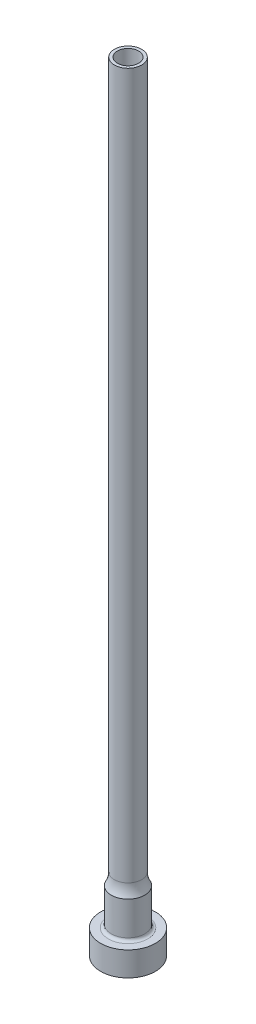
from build123d import *

# Parameters (mm, degrees)
FILLET1_R = 0.762


with BuildPart() as part:
    # Sketch1 → Revolve1 (revolve)
    with BuildSketch(Plane.XY, mode=Mode.PRIVATE) as revolve1_sk:
        with BuildLine():
            Line((2.90449, 0), (7.1374, 0))
            Line((7.1374, 0), (7.1374, 6.35))
            Line((7.1374, 6.35), (4.3688, 6.35))
            Line((4.3688, 6.35), (4.3688, 15.875))
            ThreePointArc((4.3688, 15.875), (3.769152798, 17.369844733), (3.56489, 18.967472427))
            Line((3.56489, 18.967472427), (3.56489, 203.2))
            Line((3.56489, 203.2), (2.77749, 203.2))
            Line((2.77749, 203.2), (2.77749, 139.7))
            Line((2.77749, 139.7), (2.90449, 139.626676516))
            Line((2.90449, 139.626676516), (2.90449, 0))
        make_face()
    revolve(revolve1_sk.sketch.rotate(Axis((0, 0, 0), (0, 1, 0)), 90), axis=Axis((0, 0, 0), (0, 1, 0)))

    # Fillet1
    fillet1_edges = [part.edges().sort_by_distance(p)[0] for p in [
        (0, 6.35, 4.3688),
    ]]
    fillet(fillet1_edges, radius=FILLET1_R)


solid = part.part
